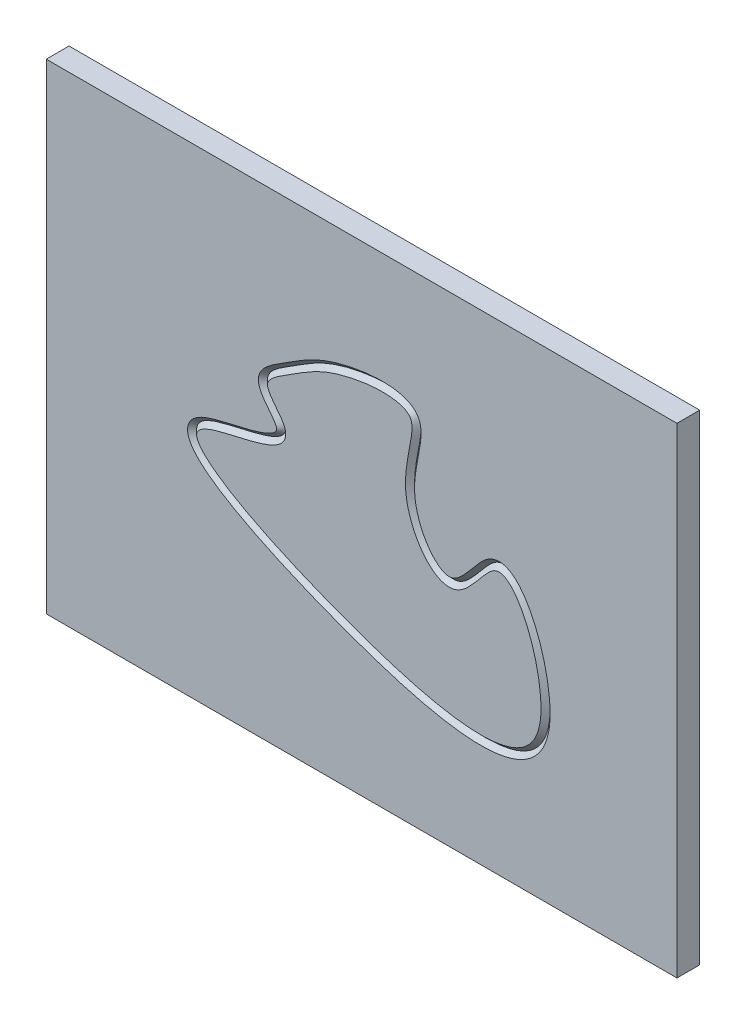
ISO-10303-21;
HEADER;
FILE_DESCRIPTION(('STEP AP214'),'2;1');
FILE_NAME('part.step','',(''),(''),'','','');
FILE_SCHEMA(('AUTOMOTIVE_DESIGN { 1 0 10303 214 1 1 1 1 }'));
ENDSEC;
DATA;
#1=APPLICATION_CONTEXT('core data for automotive mechanical design processes');
#2=APPLICATION_PROTOCOL_DEFINITION('international standard','automotive_design',2000,#1);
#3=PRODUCT_CONTEXT('',#1,'mechanical');
#4=PRODUCT('Part','Part','',(#3));
#5=PRODUCT_RELATED_PRODUCT_CATEGORY('part','',(#4));
#6=PRODUCT_DEFINITION_FORMATION('','',#4);
#7=PRODUCT_DEFINITION_CONTEXT('part definition',#1,'design');
#8=PRODUCT_DEFINITION('design','',#6,#7);
#9=PRODUCT_DEFINITION_SHAPE('','',#8);
#10=(LENGTH_UNIT() NAMED_UNIT(*) SI_UNIT(.MILLI.,.METRE.));
#11=(NAMED_UNIT(*) PLANE_ANGLE_UNIT() SI_UNIT($,.RADIAN.));
#12=(NAMED_UNIT(*) SI_UNIT($,.STERADIAN.) SOLID_ANGLE_UNIT());
#13=UNCERTAINTY_MEASURE_WITH_UNIT(LENGTH_MEASURE(1.E-05),#10,'distance_accuracy_value','');
#14=(GEOMETRIC_REPRESENTATION_CONTEXT(3) GLOBAL_UNCERTAINTY_ASSIGNED_CONTEXT((#13)) GLOBAL_UNIT_ASSIGNED_CONTEXT((#10,
#11,#12)) REPRESENTATION_CONTEXT('',''));
#15=CARTESIAN_POINT('',(0.,0.,0.));
#16=DIRECTION('',(0.,0.,1.));
#17=DIRECTION('',(1.,0.,0.));
#18=AXIS2_PLACEMENT_3D('',#15,#16,#17);
#19=CARTESIAN_POINT('',(-185.357577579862,137.493381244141,-15.));
#20=DIRECTION('',(-1.,0.,0.));
#21=DIRECTION('',(0.,0.,1.));
#22=AXIS2_PLACEMENT_3D('',#19,#20,#21);
#23=PLANE('',#22);
#24=DIRECTION('',(0.,-1.,0.));
#25=VECTOR('',#24,1.);
#26=CARTESIAN_POINT('',(-185.357577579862,137.493381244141,0.));
#27=LINE('',#26,#25);
#28=CARTESIAN_POINT('',(-185.357577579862,137.493381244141,0.));
#29=VERTEX_POINT('',#28);
#30=CARTESIAN_POINT('',(-185.357577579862,-178.842180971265,0.));
#31=VERTEX_POINT('',#30);
#32=EDGE_CURVE('E116',#29,#31,#27,.T.);
#33=ORIENTED_EDGE('',*,*,#32,.F.);
#34=DIRECTION('',(0.,0.,1.));
#35=VECTOR('',#34,1.);
#36=CARTESIAN_POINT('',(-185.357577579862,137.493381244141,-15.));
#37=LINE('',#36,#35);
#38=CARTESIAN_POINT('',(-185.357577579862,137.493381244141,-15.));
#39=VERTEX_POINT('',#38);
#40=EDGE_CURVE('E12',#39,#29,#37,.T.);
#41=ORIENTED_EDGE('',*,*,#40,.F.);
#42=DIRECTION('',(0.,-1.,0.));
#43=VECTOR('',#42,1.);
#44=CARTESIAN_POINT('',(-185.357577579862,137.493381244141,-15.));
#45=LINE('',#44,#43);
#46=CARTESIAN_POINT('',(-185.357577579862,-178.842180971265,-15.));
#47=VERTEX_POINT('',#46);
#48=EDGE_CURVE('E109',#39,#47,#45,.T.);
#49=ORIENTED_EDGE('',*,*,#48,.T.);
#50=DIRECTION('',(0.,0.,1.));
#51=VECTOR('',#50,1.);
#52=CARTESIAN_POINT('',(-185.357577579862,-178.842180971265,-15.));
#53=LINE('',#52,#51);
#54=EDGE_CURVE('E54',#47,#31,#53,.T.);
#55=ORIENTED_EDGE('',*,*,#54,.T.);
#56=EDGE_LOOP('',(#33,#41,#49,#55));
#57=FACE_BOUND('',#56,.T.);
#58=ADVANCED_FACE('F51',(#57),#23,.T.);
#59=CARTESIAN_POINT('',(-185.357577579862,137.493381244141,-15.));
#60=DIRECTION('',(0.,1.,0.));
#61=DIRECTION('',(0.,0.,1.));
#62=AXIS2_PLACEMENT_3D('',#59,#60,#61);
#63=PLANE('',#62);
#64=DIRECTION('',(-1.,0.,0.));
#65=VECTOR('',#64,1.);
#66=CARTESIAN_POINT('',(-185.357577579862,137.493381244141,0.));
#67=LINE('',#66,#65);
#68=CARTESIAN_POINT('',(229.967344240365,137.493381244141,0.));
#69=VERTEX_POINT('',#68);
#70=EDGE_CURVE('E111',#69,#29,#67,.T.);
#71=ORIENTED_EDGE('',*,*,#70,.F.);
#72=DIRECTION('',(0.,0.,1.));
#73=VECTOR('',#72,1.);
#74=CARTESIAN_POINT('',(229.967344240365,137.493381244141,-15.));
#75=LINE('',#74,#73);
#76=CARTESIAN_POINT('',(229.967344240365,137.493381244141,-15.));
#77=VERTEX_POINT('',#76);
#78=EDGE_CURVE('E60',#77,#69,#75,.T.);
#79=ORIENTED_EDGE('',*,*,#78,.F.);
#80=DIRECTION('',(-1.,0.,0.));
#81=VECTOR('',#80,1.);
#82=CARTESIAN_POINT('',(-185.357577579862,137.493381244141,-15.));
#83=LINE('',#82,#81);
#84=EDGE_CURVE('E106',#77,#39,#83,.T.);
#85=ORIENTED_EDGE('',*,*,#84,.T.);
#86=ORIENTED_EDGE('',*,*,#40,.T.);
#87=EDGE_LOOP('',(#71,#79,#85,#86));
#88=FACE_BOUND('',#87,.T.);
#89=ADVANCED_FACE('F127',(#88),#63,.T.);
#90=CARTESIAN_POINT('',(229.967344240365,137.493381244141,-15.));
#91=DIRECTION('',(1.,0.,0.));
#92=DIRECTION('',(0.,0.,-1.));
#93=AXIS2_PLACEMENT_3D('',#90,#91,#92);
#94=PLANE('',#93);
#95=DIRECTION('',(0.,1.,0.));
#96=VECTOR('',#95,1.);
#97=CARTESIAN_POINT('',(229.967344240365,137.493381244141,0.));
#98=LINE('',#97,#96);
#99=CARTESIAN_POINT('',(229.967344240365,-178.842180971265,0.));
#100=VERTEX_POINT('',#99);
#101=EDGE_CURVE('E101',#100,#69,#98,.T.);
#102=ORIENTED_EDGE('',*,*,#101,.F.);
#103=DIRECTION('',(0.,0.,1.));
#104=VECTOR('',#103,1.);
#105=CARTESIAN_POINT('',(229.967344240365,-178.842180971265,-15.));
#106=LINE('',#105,#104);
#107=CARTESIAN_POINT('',(229.967344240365,-178.842180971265,-15.));
#108=VERTEX_POINT('',#107);
#109=EDGE_CURVE('E96',#108,#100,#106,.T.);
#110=ORIENTED_EDGE('',*,*,#109,.F.);
#111=DIRECTION('',(0.,1.,0.));
#112=VECTOR('',#111,1.);
#113=CARTESIAN_POINT('',(229.967344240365,137.493381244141,-15.));
#114=LINE('',#113,#112);
#115=EDGE_CURVE('E99',#108,#77,#114,.T.);
#116=ORIENTED_EDGE('',*,*,#115,.T.);
#117=ORIENTED_EDGE('',*,*,#78,.T.);
#118=EDGE_LOOP('',(#102,#110,#116,#117));
#119=FACE_BOUND('',#118,.T.);
#120=ADVANCED_FACE('F98',(#119),#94,.T.);
#121=CARTESIAN_POINT('',(-185.357577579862,-178.842180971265,-15.));
#122=DIRECTION('',(0.,-1.,0.));
#123=DIRECTION('',(0.,0.,-1.));
#124=AXIS2_PLACEMENT_3D('',#121,#122,#123);
#125=PLANE('',#124);
#126=DIRECTION('',(1.,0.,0.));
#127=VECTOR('',#126,1.);
#128=CARTESIAN_POINT('',(-185.357577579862,-178.842180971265,0.));
#129=LINE('',#128,#127);
#130=EDGE_CURVE('E119',#31,#100,#129,.T.);
#131=ORIENTED_EDGE('',*,*,#130,.F.);
#132=ORIENTED_EDGE('',*,*,#54,.F.);
#133=DIRECTION('',(1.,0.,0.));
#134=VECTOR('',#133,1.);
#135=CARTESIAN_POINT('',(-185.357577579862,-178.842180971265,-15.));
#136=LINE('',#135,#134);
#137=EDGE_CURVE('E105',#47,#108,#136,.T.);
#138=ORIENTED_EDGE('',*,*,#137,.T.);
#139=ORIENTED_EDGE('',*,*,#109,.T.);
#140=EDGE_LOOP('',(#131,#132,#138,#139));
#141=FACE_BOUND('',#140,.T.);
#142=ADVANCED_FACE('F108',(#141),#125,.T.);
#143=CARTESIAN_POINT('',(-185.357577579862,-178.842180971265,-15.));
#144=DIRECTION('',(0.,0.,1.));
#145=DIRECTION('',(1.,0.,0.));
#146=AXIS2_PLACEMENT_3D('',#143,#144,#145);
#147=PLANE('',#146);
#148=ORIENTED_EDGE('',*,*,#48,.F.);
#149=ORIENTED_EDGE('',*,*,#84,.F.);
#150=ORIENTED_EDGE('',*,*,#115,.F.);
#151=ORIENTED_EDGE('',*,*,#137,.F.);
#152=EDGE_LOOP('',(#148,#149,#150,#151));
#153=FACE_BOUND('',#152,.T.);
#154=ADVANCED_FACE('F104',(#153),#147,.F.);
#155=CARTESIAN_POINT('',(-185.357577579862,-178.842180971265,0.));
#156=DIRECTION('',(0.,0.,1.));
#157=DIRECTION('',(1.,0.,0.));
#158=AXIS2_PLACEMENT_3D('',#155,#156,#157);
#159=PLANE('',#158);
#160=CARTESIAN_POINT('',(-28.9610457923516,42.4194717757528,0.));
#161=CARTESIAN_POINT('',(-31.3596570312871,40.9239144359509,0.));
#162=CARTESIAN_POINT('',(-36.5282389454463,37.7757005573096,0.));
#163=CARTESIAN_POINT('',(-41.7431895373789,33.5285812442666,0.));
#164=CARTESIAN_POINT('',(-44.1840860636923,30.0135024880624,0.));
#165=CARTESIAN_POINT('',(-45.1233597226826,28.0652061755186,0.));
#166=CARTESIAN_POINT('',(-45.6066969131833,26.2082258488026,0.));
#167=CARTESIAN_POINT('',(-45.7030968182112,24.6866749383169,0.));
#168=CARTESIAN_POINT('',(-45.6121095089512,22.9183443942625,0.));
#169=CARTESIAN_POINT('',(-45.0581061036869,20.7255390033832,0.));
#170=CARTESIAN_POINT('',(-43.8311611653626,18.0980591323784,0.));
#171=CARTESIAN_POINT('',(-41.2542666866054,13.9620516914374,0.));
#172=CARTESIAN_POINT('',(-36.7559472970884,8.62488937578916,0.));
#173=CARTESIAN_POINT('',(-34.2795900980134,4.80595829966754,0.));
#174=CARTESIAN_POINT('',(-33.7606687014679,3.31769811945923,0.));
#175=CARTESIAN_POINT('',(-33.6564605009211,2.81054166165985,0.));
#176=CARTESIAN_POINT('',(-33.6474759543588,2.2052734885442,0.));
#177=CARTESIAN_POINT('',(-33.7586134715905,1.67394307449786,0.));
#178=CARTESIAN_POINT('',(-34.0323540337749,1.0464044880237,0.));
#179=CARTESIAN_POINT('',(-34.6124061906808,0.246659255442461,0.));
#180=CARTESIAN_POINT('',(-35.6744779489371,-0.727251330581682,0.));
#181=CARTESIAN_POINT('',(-38.647036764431,-2.74686395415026,0.));
#182=CARTESIAN_POINT('',(-45.9421427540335,-5.60663483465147,0.));
#183=CARTESIAN_POINT('',(-59.1605846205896,-8.81589340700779,0.));
#184=CARTESIAN_POINT('',(-71.9027962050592,-11.6349220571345,0.));
#185=CARTESIAN_POINT('',(-80.1466192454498,-14.167253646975,0.));
#186=CARTESIAN_POINT('',(-84.2592403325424,-16.1079079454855,0.));
#187=CARTESIAN_POINT('',(-86.5151077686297,-17.4617794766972,0.));
#188=CARTESIAN_POINT('',(-88.3611262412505,-18.8898538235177,0.));
#189=CARTESIAN_POINT('',(-89.9019303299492,-20.4802282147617,0.));
#190=CARTESIAN_POINT('',(-91.1085942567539,-22.2498774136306,0.));
#191=CARTESIAN_POINT('',(-91.9328273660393,-24.1851010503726,0.));
#192=CARTESIAN_POINT('',(-92.3331022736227,-26.2250506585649,0.));
#193=CARTESIAN_POINT('',(-92.3121625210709,-28.2852975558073,0.));
#194=CARTESIAN_POINT('',(-91.8716461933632,-30.5304271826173,0.));
#195=CARTESIAN_POINT('',(-90.9325865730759,-32.9163970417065,0.));
#196=CARTESIAN_POINT('',(-89.4383565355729,-35.4383160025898,0.));
#197=CARTESIAN_POINT('',(-87.5255157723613,-37.920208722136,0.));
#198=CARTESIAN_POINT('',(-82.5525286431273,-43.2533476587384,0.));
#199=CARTESIAN_POINT('',(-71.5471916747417,-51.5605293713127,0.));
#200=CARTESIAN_POINT('',(-50.9594298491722,-63.1418014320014,0.));
#201=CARTESIAN_POINT('',(-23.6210506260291,-75.95599894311,0.));
#202=CARTESIAN_POINT('',(6.24939582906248,-87.9281783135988,0.));
#203=CARTESIAN_POINT('',(38.0741577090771,-99.0796874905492,0.));
#204=CARTESIAN_POINT('',(67.9134180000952,-107.41359175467,0.));
#205=CARTESIAN_POINT('',(91.0227383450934,-110.861772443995,0.));
#206=CARTESIAN_POINT('',(106.299870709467,-110.837093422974,0.));
#207=CARTESIAN_POINT('',(115.632256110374,-109.714194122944,0.));
#208=CARTESIAN_POINT('',(124.034302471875,-107.356065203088,0.));
#209=CARTESIAN_POINT('',(131.395628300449,-103.611017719,0.));
#210=CARTESIAN_POINT('',(137.188837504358,-98.6365437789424,0.));
#211=CARTESIAN_POINT('',(141.449522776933,-92.6905578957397,0.));
#212=CARTESIAN_POINT('',(144.330877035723,-86.0762389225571,0.));
#213=CARTESIAN_POINT('',(145.876180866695,-79.2677079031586,0.));
#214=CARTESIAN_POINT('',(146.379940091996,-73.6039308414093,0.));
#215=CARTESIAN_POINT('',(146.493923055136,-67.5941116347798,0.));
#216=CARTESIAN_POINT('',(146.053422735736,-60.1658356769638,0.));
#217=CARTESIAN_POINT('',(144.148965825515,-47.7642432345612,0.));
#218=CARTESIAN_POINT('',(140.197917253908,-32.8597857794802,0.));
#219=CARTESIAN_POINT('',(134.991829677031,-20.4311780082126,0.));
#220=CARTESIAN_POINT('',(130.442435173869,-12.6310854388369,0.));
#221=CARTESIAN_POINT('',(127.194920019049,-8.14202830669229,0.));
#222=CARTESIAN_POINT('',(123.686182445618,-4.42463827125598,0.));
#223=CARTESIAN_POINT('',(120.488422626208,-2.07230493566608,0.));
#224=CARTESIAN_POINT('',(117.716793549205,-0.750476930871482,0.));
#225=CARTESIAN_POINT('',(115.521429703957,-0.0873596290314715,0.));
#226=CARTESIAN_POINT('',(113.2383582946,0.190393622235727,0.));
#227=CARTESIAN_POINT('',(110.913334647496,0.0357129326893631,0.));
#228=CARTESIAN_POINT('',(108.699918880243,-0.541706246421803,0.));
#229=CARTESIAN_POINT('',(107.206913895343,-1.2245754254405,0.));
#230=CARTESIAN_POINT('',(104.318464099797,-2.83237678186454,0.));
#231=CARTESIAN_POINT('',(100.400620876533,-6.37855822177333,0.));
#232=CARTESIAN_POINT('',(95.58489831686,-12.1615401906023,0.));
#233=CARTESIAN_POINT('',(91.4260094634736,-17.1643058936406,0.));
#234=CARTESIAN_POINT('',(87.9171676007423,-20.9255926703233,0.));
#235=CARTESIAN_POINT('',(84.6832393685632,-23.5374360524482,0.));
#236=CARTESIAN_POINT('',(82.7062218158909,-24.4803841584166,0.));
#237=CARTESIAN_POINT('',(81.1189164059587,-24.8945402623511,0.));
#238=CARTESIAN_POINT('',(79.7391255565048,-25.0167786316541,0.));
#239=CARTESIAN_POINT('',(77.7307473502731,-24.6950426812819,0.));
#240=CARTESIAN_POINT('',(75.213093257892,-23.7003233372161,0.));
#241=CARTESIAN_POINT('',(72.1598007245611,-21.655004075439,0.));
#242=CARTESIAN_POINT('',(67.5826107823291,-17.0909219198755,0.));
#243=CARTESIAN_POINT('',(62.367810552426,-9.07033508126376,0.));
#244=CARTESIAN_POINT('',(58.8144322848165,0.596208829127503,0.));
#245=CARTESIAN_POINT('',(57.3646585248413,8.46348674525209,0.));
#246=CARTESIAN_POINT('',(56.9966510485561,16.2476741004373,0.));
#247=CARTESIAN_POINT('',(58.4623767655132,29.7729687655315,0.));
#248=CARTESIAN_POINT('',(61.5302268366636,41.2959861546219,0.));
#249=CARTESIAN_POINT('',(61.4706437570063,49.2976059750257,0.));
#250=CARTESIAN_POINT('',(61.0568323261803,52.1984203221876,0.));
#251=CARTESIAN_POINT('',(60.2646559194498,54.556887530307,0.));
#252=CARTESIAN_POINT('',(59.2963629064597,56.2889504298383,0.));
#253=CARTESIAN_POINT('',(58.1211176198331,57.8941629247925,0.));
#254=CARTESIAN_POINT('',(56.3659946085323,59.5690368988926,0.));
#255=CARTESIAN_POINT('',(53.2533526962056,61.5391541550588,0.));
#256=CARTESIAN_POINT('',(48.9653038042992,63.1379245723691,0.));
#257=CARTESIAN_POINT('',(43.313863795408,64.1786729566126,0.));
#258=CARTESIAN_POINT('',(37.0971039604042,64.5523483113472,0.));
#259=CARTESIAN_POINT('',(25.7272133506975,64.2021459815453,0.));
#260=CARTESIAN_POINT('',(11.5116185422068,61.7487078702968,0.));
#261=CARTESIAN_POINT('',(-2.7982052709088,57.1753476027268,0.));
#262=CARTESIAN_POINT('',(-15.028069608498,51.499843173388,0.));
#263=CARTESIAN_POINT('',(-22.5647491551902,46.4076246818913,0.));
#264=CARTESIAN_POINT('',(-28.9610457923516,42.4194717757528,0.));
#265=B_SPLINE_CURVE_WITH_KNOTS('',3,(#160,#161,#162,#163,#164,#165,#166,#167,#168,#169,#170,
#171,#172,#173,#174,#175,#176,#177,#178,#179,#180,#181,#182,#183,#184,#185,#186,#187,#188,#189,
#190,#191,#192,#193,#194,#195,#196,#197,#198,#199,#200,#201,#202,#203,#204,#205,#206,#207,#208,
#209,#210,#211,#212,#213,#214,#215,#216,#217,#218,#219,#220,#221,#222,#223,#224,#225,#226,#227,
#228,#229,#230,#231,#232,#233,#234,#235,#236,#237,#238,#239,#240,#241,#242,#243,#244,#245,#246,
#247,#248,#249,#250,#251,#252,#253,#254,#255,#256,#257,#258,#259,#260,#261,#262,#263,#264),
.UNSPECIFIED.,.T.,.F.,(4,1,1,1,1,1,1,1,1,1,1,1,1,1,1,1,1,1,1,1,1,1,1,1,1,1,1,1,1,1,1,1,1,1,1,1,
1,1,1,1,1,1,1,1,1,1,1,1,1,1,1,1,1,1,1,1,1,1,1,1,1,1,1,1,1,1,1,1,1,1,1,1,1,1,1,1,1,1,1,1,1,1,1,1,
1,1,1,1,1,1,1,1,1,1,1,1,1,1,1,1,1,1,4),(0.,0.01171875,0.0234375,0.0263671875,0.029296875,
0.0322265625,0.0339758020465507,0.03515625,0.0390625,0.04296875,0.0468750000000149,0.05859375,
0.0702791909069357,0.0703125,0.0732421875,0.076171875,0.0791015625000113,0.08203125,0.0859375,
0.08984375,0.09375,0.109375,0.125,0.142578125,0.155106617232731,0.16015624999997,0.16455078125,
0.1689453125,0.173339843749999,0.177734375,0.18212890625,0.1865234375,0.19091796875,
0.195312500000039,0.201171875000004,0.20703125,0.212890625,0.218750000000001,0.245000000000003,
0.27125,0.2975,0.333051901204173,0.359375,0.39453125,0.4296875,0.44375,0.4578125,0.471875,
0.4859375,0.5,0.51171875,0.523437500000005,0.53515625,0.54310440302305,0.546875,0.55859375,
0.5703125,0.59,0.6096875,0.61742187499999,0.62515625,0.632890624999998,0.640625,0.64453125,
0.648437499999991,0.652343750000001,0.65625,0.66015625,0.663632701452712,0.6640625,0.67578125,
0.6875,0.6953125,0.703125,0.710937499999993,0.717533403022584,0.71875,0.723958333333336,
0.729166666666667,0.734375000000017,0.7421875,0.750000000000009,0.765625,0.78125,
0.788869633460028,0.796875,0.8125,0.84375,0.848958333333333,0.854166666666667,0.859375,
0.862241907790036,0.864583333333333,0.869791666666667,0.875,0.88375000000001,0.8925,0.90125,
0.91,0.9375,0.953600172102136,0.96875,1.),.UNSPECIFIED.);
#266=CARTESIAN_POINT('',(-28.9610457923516,42.4194717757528,0.));
#267=VERTEX_POINT('',#266);
#268=EDGE_CURVE('E178',#267,#267,#265,.T.);
#269=ORIENTED_EDGE('',*,*,#268,.F.);
#270=EDGE_LOOP('',(#269));
#271=FACE_BOUND('',#270,.T.);
#272=ORIENTED_EDGE('',*,*,#32,.T.);
#273=ORIENTED_EDGE('',*,*,#130,.T.);
#274=ORIENTED_EDGE('',*,*,#101,.T.);
#275=ORIENTED_EDGE('',*,*,#70,.T.);
#276=EDGE_LOOP('',(#272,#273,#274,#275));
#277=FACE_BOUND('',#276,.T.);
#278=ADVANCED_FACE('F126',(#271,#277),#159,.T.);
#279=CARTESIAN_POINT('',(-27.3753796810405,39.8727752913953,-3.00000000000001));
#280=CARTESIAN_POINT('',(-29.7592075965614,38.3885170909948,-3.00000000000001));
#281=CARTESIAN_POINT('',(-34.8885349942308,35.2678333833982,-3.00000000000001));
#282=CARTESIAN_POINT('',(-39.6288274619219,31.3249604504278,-3.));
#283=CARTESIAN_POINT('',(-41.5914546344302,28.4789488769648,-3.));
#284=CARTESIAN_POINT('',(-42.2948387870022,27.0105878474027,-3.00000000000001));
#285=CARTESIAN_POINT('',(-42.6298949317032,25.6985586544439,-3.00000000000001));
#286=CARTESIAN_POINT('',(-42.6990609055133,24.6620327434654,-3.));
#287=CARTESIAN_POINT('',(-42.6328718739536,23.433226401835,-3.00000000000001));
#288=CARTESIAN_POINT('',(-42.229992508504,21.7758341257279,-3.00000000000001));
#289=CARTESIAN_POINT('',(-41.2033673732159,19.5591693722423,-3.00000000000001));
#290=CARTESIAN_POINT('',(-38.8736402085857,15.8112866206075,-3.00000000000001));
#291=CARTESIAN_POINT('',(-34.4936725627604,10.5369892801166,-3.));
#292=CARTESIAN_POINT('',(-31.636368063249,6.41395852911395,-3.));
#293=CARTESIAN_POINT('',(-30.8642104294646,4.10263205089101,-3.00000000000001));
#294=CARTESIAN_POINT('',(-30.6566309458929,3.19984243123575,-3.));
#295=CARTESIAN_POINT('',(-30.6349418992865,1.92912668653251,-3.));
#296=CARTESIAN_POINT('',(-30.8851776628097,0.730411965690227,-3.00000000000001));
#297=CARTESIAN_POINT('',(-31.4475835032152,-0.525728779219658,-3.));
#298=CARTESIAN_POINT('',(-32.4083582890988,-1.81568950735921,-3.00000000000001));
#299=CARTESIAN_POINT('',(-33.8451110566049,-3.11751297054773,-3.));
#300=CARTESIAN_POINT('',(-37.42005657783,-5.52842337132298,-3.00000000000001));
#301=CARTESIAN_POINT('',(-45.1285136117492,-8.48981319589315,-3.));
#302=CARTESIAN_POINT('',(-58.5204683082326,-11.7498968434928,-3.));
#303=CARTESIAN_POINT('',(-71.2204901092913,-14.5540456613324,-3.));
#304=CARTESIAN_POINT('',(-79.1208348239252,-17.0062414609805,-3.));
#305=CARTESIAN_POINT('',(-82.8657655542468,-18.769354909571,-3.));
#306=CARTESIAN_POINT('',(-84.8328899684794,-19.954316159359,-3.));
#307=CARTESIAN_POINT('',(-86.3691660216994,-21.1465828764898,-3.));
#308=CARTESIAN_POINT('',(-87.5770705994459,-22.3995747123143,-3.00000000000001));
#309=CARTESIAN_POINT('',(-88.4659600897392,-23.7106171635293,-3.00000000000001));
#310=CARTESIAN_POINT('',(-89.0451908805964,-25.077035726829,-3.00000000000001));
#311=CARTESIAN_POINT('',(-89.324119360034,-26.4961558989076,-3.00000000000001));
#312=CARTESIAN_POINT('',(-89.3121019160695,-27.9653031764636,-3.00000000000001));
#313=CARTESIAN_POINT('',(-88.9858719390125,-29.6503030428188,-3.));
#314=CARTESIAN_POINT('',(-88.238834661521,-31.5675105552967,-3.));
#315=CARTESIAN_POINT('',(-86.9620929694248,-33.7320978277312,-3.00000000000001));
#316=CARTESIAN_POINT('',(-85.2457374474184,-35.9634337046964,-3.));
#317=CARTESIAN_POINT('',(-80.6367483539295,-40.9136027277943,-3.00000000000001));
#318=CARTESIAN_POINT('',(-69.9569818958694,-49.0140550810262,-3.00000000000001));
#319=CARTESIAN_POINT('',(-49.6069052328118,-60.459957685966,-3.));
#320=CARTESIAN_POINT('',(-22.4424753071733,-73.1965114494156,-3.00000000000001));
#321=CARTESIAN_POINT('',(7.31396324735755,-85.1204762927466,-3.00000000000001));
#322=CARTESIAN_POINT('',(38.9881717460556,-96.2209973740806,-3.));
#323=CARTESIAN_POINT('',(68.5858662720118,-104.483915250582,-3.));
#324=CARTESIAN_POINT('',(91.3245507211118,-107.863193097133,-3.));
#325=CARTESIAN_POINT('',(106.140463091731,-107.834488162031,-3.));
#326=CARTESIAN_POINT('',(115.072389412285,-106.755153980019,-3.00000000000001));
#327=CARTESIAN_POINT('',(122.966228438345,-104.531867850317,-3.));
#328=CARTESIAN_POINT('',(129.729241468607,-101.080875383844,-3.00000000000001));
#329=CARTESIAN_POINT('',(134.960942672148,-96.5830029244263,-3.));
#330=CARTESIAN_POINT('',(138.812353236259,-91.2128692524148,-3.00000000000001));
#331=CARTESIAN_POINT('',(141.455282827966,-85.1610005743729,-3.00000000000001));
#332=CARTESIAN_POINT('',(142.902867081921,-78.806686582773,-3.));
#333=CARTESIAN_POINT('',(143.382434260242,-73.4381905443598,-3.00000000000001));
#334=CARTESIAN_POINT('',(143.4914999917,-67.687301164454,-3.00000000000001));
#335=CARTESIAN_POINT('',(143.067738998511,-60.4964185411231,-3.00000000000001));
#336=CARTESIAN_POINT('',(141.211195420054,-48.400457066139,-3.));
#337=CARTESIAN_POINT('',(137.344950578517,-33.8120471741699,-3.00000000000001));
#338=CARTESIAN_POINT('',(132.27014867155,-21.7172628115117,-3.));
#339=CARTESIAN_POINT('',(127.914652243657,-14.2553856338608,-3.));
#340=CARTESIAN_POINT('',(124.860093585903,-10.0385562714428,-3.00000000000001));
#341=CARTESIAN_POINT('',(121.657266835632,-6.6554265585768,-3.00000000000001));
#342=CARTESIAN_POINT('',(118.885485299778,-4.63156286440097,-3.00000000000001));
#343=CARTESIAN_POINT('',(116.618524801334,-3.55469142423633,-3.));
#344=CARTESIAN_POINT('',(114.892172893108,-3.03594929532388,-3.));
#345=CARTESIAN_POINT('',(113.152312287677,-2.82636936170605,-3.00000000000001));
#346=CARTESIAN_POINT('',(111.403022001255,-2.94214380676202,-3.));
#347=CARTESIAN_POINT('',(109.712734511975,-3.38269204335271,-3.00000000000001));
#348=CARTESIAN_POINT('',(108.542172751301,-3.91294473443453,-3.00000000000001));
#349=CARTESIAN_POINT('',(106.202621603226,-5.22154966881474,-3.00000000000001));
#350=CARTESIAN_POINT('',(102.635454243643,-8.37891172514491,-3.));
#351=CARTESIAN_POINT('',(97.9154873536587,-14.0506582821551,-3.));
#352=CARTESIAN_POINT('',(93.7014874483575,-19.1222366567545,-3.00000000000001));
#353=CARTESIAN_POINT('',(90.0099188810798,-23.0810667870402,-3.));
#354=CARTESIAN_POINT('',(86.413724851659,-26.0274994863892,-3.00000000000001));
#355=CARTESIAN_POINT('',(83.8090988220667,-27.2915877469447,-3.));
#356=CARTESIAN_POINT('',(81.5991334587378,-27.8714697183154,-3.));
#357=CARTESIAN_POINT('',(79.5991445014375,-28.0478418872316,-3.));
#358=CARTESIAN_POINT('',(76.8894853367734,-27.5984995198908,-3.));
#359=CARTESIAN_POINT('',(73.7384477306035,-26.3411940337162,-3.00000000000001));
#360=CARTESIAN_POINT('',(70.2055136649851,-23.9535022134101,-3.));
#361=CARTESIAN_POINT('',(65.1737814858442,-18.921060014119,-3.00000000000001));
#362=CARTESIAN_POINT('',(59.65752498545,-10.3984685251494,-3.));
#363=CARTESIAN_POINT('',(55.9151281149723,-0.252587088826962,-3.00000000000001));
#364=CARTESIAN_POINT('',(54.3817349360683,8.12528751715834,-3.00000000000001));
#365=CARTESIAN_POINT('',(53.9813300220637,16.3975942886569,-3.00000000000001));
#366=CARTESIAN_POINT('',(55.5409359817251,30.4228102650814,-3.00000000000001));
#367=CARTESIAN_POINT('',(58.538475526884,41.9717529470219,-3.));
#368=CARTESIAN_POINT('',(58.4678577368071,49.0997865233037,-3.));
#369=CARTESIAN_POINT('',(58.1159346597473,51.5284808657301,-3.00000000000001));
#370=CARTESIAN_POINT('',(57.4882632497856,53.3701150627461,-3.));
#371=CARTESIAN_POINT('',(56.7648721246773,54.6692774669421,-3.00000000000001));
#372=CARTESIAN_POINT('',(55.8811896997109,55.8715900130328,-3.00000000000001));
#373=CARTESIAN_POINT('',(54.5252741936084,57.1755863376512,-3.));
#374=CARTESIAN_POINT('',(51.9717511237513,58.8007620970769,-3.));
#375=CARTESIAN_POINT('',(48.2067103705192,60.2209601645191,-3.));
#376=CARTESIAN_POINT('',(42.9781072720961,61.1905566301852,-3.00000000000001));
#377=CARTESIAN_POINT('',(37.0687769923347,61.5482409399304,-3.));
#378=CARTESIAN_POINT('',(26.1068961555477,61.2156015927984,-3.00000000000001));
#379=CARTESIAN_POINT('',(12.1587090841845,58.7980791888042,-3.00000000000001));
#380=CARTESIAN_POINT('',(-1.68044804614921,54.3989604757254,-3.));
#381=CARTESIAN_POINT('',(-13.4892146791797,48.9043140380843,-3.));
#382=CARTESIAN_POINT('',(-21.0185052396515,43.8307971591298,-3.00000000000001));
#383=CARTESIAN_POINT('',(-27.3753796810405,39.8727752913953,-3.00000000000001));
#384=CARTESIAN_POINT('',(-25.7897135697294,37.3260788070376,0.));
#385=CARTESIAN_POINT('',(-28.1587581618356,35.8531197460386,0.));
#386=CARTESIAN_POINT('',(-33.2488310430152,32.7599662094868,0.));
#387=CARTESIAN_POINT('',(-37.5144653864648,29.121339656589,0.));
#388=CARTESIAN_POINT('',(-38.9988232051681,26.9443952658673,0.));
#389=CARTESIAN_POINT('',(-39.4663178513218,25.9559695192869,0.));
#390=CARTESIAN_POINT('',(-39.653092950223,25.1888914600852,0.));
#391=CARTESIAN_POINT('',(-39.6950249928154,24.6373905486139,0.));
#392=CARTESIAN_POINT('',(-39.6536342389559,23.9481084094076,0.));
#393=CARTESIAN_POINT('',(-39.401878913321,22.8261292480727,0.));
#394=CARTESIAN_POINT('',(-38.575573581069,21.0202796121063,0.));
#395=CARTESIAN_POINT('',(-36.4930137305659,17.6605215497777,0.));
#396=CARTESIAN_POINT('',(-32.2313978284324,12.4490891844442,0.));
#397=CARTESIAN_POINT('',(-28.9931460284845,8.02195875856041,0.));
#398=CARTESIAN_POINT('',(-27.9677521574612,4.88756598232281,0.));
#399=CARTESIAN_POINT('',(-27.6568013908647,3.58914320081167,0.));
#400=CARTESIAN_POINT('',(-27.6224078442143,1.65297988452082,0.));
#401=CARTESIAN_POINT('',(-28.0117418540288,-0.213119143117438,0.));
#402=CARTESIAN_POINT('',(-28.8628129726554,-2.09786204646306,0.));
#403=CARTESIAN_POINT('',(-30.2043103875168,-3.87803827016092,0.));
#404=CARTESIAN_POINT('',(-32.0157441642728,-5.50777461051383,0.));
#405=CARTESIAN_POINT('',(-36.193076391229,-8.30998278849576,0.));
#406=CARTESIAN_POINT('',(-44.3148844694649,-11.3729915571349,0.));
#407=CARTESIAN_POINT('',(-57.8803519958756,-14.6839002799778,0.));
#408=CARTESIAN_POINT('',(-70.5381840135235,-17.4731692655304,0.));
#409=CARTESIAN_POINT('',(-78.0950504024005,-19.8452292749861,0.));
#410=CARTESIAN_POINT('',(-81.4722907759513,-21.4308018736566,0.));
#411=CARTESIAN_POINT('',(-83.1506721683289,-22.4468528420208,0.));
#412=CARTESIAN_POINT('',(-84.3772058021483,-23.403311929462,0.));
#413=CARTESIAN_POINT('',(-85.2522108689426,-24.3189212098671,0.));
#414=CARTESIAN_POINT('',(-85.8233259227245,-25.171356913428,0.));
#415=CARTESIAN_POINT('',(-86.1575543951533,-25.9689704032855,0.));
#416=CARTESIAN_POINT('',(-86.3151364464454,-26.7672611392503,0.));
#417=CARTESIAN_POINT('',(-86.312041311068,-27.6453087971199,0.));
#418=CARTESIAN_POINT('',(-86.1000976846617,-28.7701789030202,0.));
#419=CARTESIAN_POINT('',(-85.545082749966,-30.218624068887,0.));
#420=CARTESIAN_POINT('',(-84.4858294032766,-32.0258796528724,0.));
#421=CARTESIAN_POINT('',(-82.9659591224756,-34.0066586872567,0.));
#422=CARTESIAN_POINT('',(-78.7209680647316,-38.5738577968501,0.));
#423=CARTESIAN_POINT('',(-68.3667721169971,-46.4675807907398,0.));
#424=CARTESIAN_POINT('',(-48.2543806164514,-57.7781139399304,0.));
#425=CARTESIAN_POINT('',(-21.2638999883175,-70.4370239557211,0.));
#426=CARTESIAN_POINT('',(8.37853066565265,-82.3127742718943,0.));
#427=CARTESIAN_POINT('',(39.9021857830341,-93.3623072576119,0.));
#428=CARTESIAN_POINT('',(69.2583145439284,-101.554238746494,0.));
#429=CARTESIAN_POINT('',(91.6263630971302,-104.864613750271,0.));
#430=CARTESIAN_POINT('',(105.981055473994,-104.831882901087,0.));
#431=CARTESIAN_POINT('',(114.512522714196,-103.796113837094,0.));
#432=CARTESIAN_POINT('',(121.898154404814,-101.707670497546,0.));
#433=CARTESIAN_POINT('',(128.062854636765,-98.5507330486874,0.));
#434=CARTESIAN_POINT('',(132.733047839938,-94.5294620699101,0.));
#435=CARTESIAN_POINT('',(136.175183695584,-89.7351806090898,0.));
#436=CARTESIAN_POINT('',(138.579688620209,-84.2457622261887,0.));
#437=CARTESIAN_POINT('',(139.929553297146,-78.3456652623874,0.));
#438=CARTESIAN_POINT('',(140.384928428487,-73.2724502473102,0.));
#439=CARTESIAN_POINT('',(140.489076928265,-67.7804906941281,0.));
#440=CARTESIAN_POINT('',(140.082055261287,-60.8270014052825,0.));
#441=CARTESIAN_POINT('',(138.273425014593,-49.0366708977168,0.));
#442=CARTESIAN_POINT('',(134.491983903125,-34.7643085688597,0.));
#443=CARTESIAN_POINT('',(129.54846766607,-23.0033476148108,0.));
#444=CARTESIAN_POINT('',(125.386869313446,-15.8796858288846,0.));
#445=CARTESIAN_POINT('',(122.525267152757,-11.9350842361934,0.));
#446=CARTESIAN_POINT('',(119.628351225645,-8.88621484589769,0.));
#447=CARTESIAN_POINT('',(117.282547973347,-7.19082079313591,0.));
#448=CARTESIAN_POINT('',(115.520256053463,-6.35890591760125,0.));
#449=CARTESIAN_POINT('',(114.262916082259,-5.98453896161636,0.));
#450=CARTESIAN_POINT('',(113.066266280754,-5.84313234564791,0.));
#451=CARTESIAN_POINT('',(111.892709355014,-5.92000054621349,0.));
#452=CARTESIAN_POINT('',(110.725550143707,-6.22367784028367,0.));
#453=CARTESIAN_POINT('',(109.877431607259,-6.60131404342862,0.));
#454=CARTESIAN_POINT('',(108.086779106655,-7.61072255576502,0.));
#455=CARTESIAN_POINT('',(104.870287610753,-10.3792652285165,0.));
#456=CARTESIAN_POINT('',(100.246076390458,-15.9397763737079,0.));
#457=CARTESIAN_POINT('',(95.9769654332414,-21.0801674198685,0.));
#458=CARTESIAN_POINT('',(92.1026701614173,-25.2365409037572,0.));
#459=CARTESIAN_POINT('',(88.1442103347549,-28.5175629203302,0.));
#460=CARTESIAN_POINT('',(84.9119758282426,-30.102791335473,0.));
#461=CARTESIAN_POINT('',(82.0793505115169,-30.8483991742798,0.));
#462=CARTESIAN_POINT('',(79.4591634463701,-31.0789051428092,0.));
#463=CARTESIAN_POINT('',(76.0482233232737,-30.5019563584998,0.));
#464=CARTESIAN_POINT('',(72.263802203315,-28.9820647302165,0.));
#465=CARTESIAN_POINT('',(68.2512266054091,-26.2520003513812,0.));
#466=CARTESIAN_POINT('',(62.7649521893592,-20.7511981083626,0.));
#467=CARTESIAN_POINT('',(56.9472394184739,-11.726601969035,0.));
#468=CARTESIAN_POINT('',(53.015823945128,-1.10138300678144,0.));
#469=CARTESIAN_POINT('',(51.3988113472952,7.78708828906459,0.));
#470=CARTESIAN_POINT('',(50.9660089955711,16.5475144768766,0.));
#471=CARTESIAN_POINT('',(52.6194951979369,31.0726517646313,0.));
#472=CARTESIAN_POINT('',(55.5467242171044,42.6475197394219,0.));
#473=CARTESIAN_POINT('',(55.4650717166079,48.9019670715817,0.));
#474=CARTESIAN_POINT('',(55.1750369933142,50.8585414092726,0.));
#475=CARTESIAN_POINT('',(54.7118705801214,52.1833425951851,0.));
#476=CARTESIAN_POINT('',(54.2333813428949,53.0496045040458,0.));
#477=CARTESIAN_POINT('',(53.6412617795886,53.849017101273,0.));
#478=CARTESIAN_POINT('',(52.6845537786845,54.7821357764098,0.));
#479=CARTESIAN_POINT('',(50.690149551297,56.062370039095,0.));
#480=CARTESIAN_POINT('',(47.4481169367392,57.3039957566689,0.));
#481=CARTESIAN_POINT('',(42.6423507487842,58.2024403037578,0.));
#482=CARTESIAN_POINT('',(37.0404500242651,58.5441335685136,0.));
#483=CARTESIAN_POINT('',(26.4865789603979,58.2290572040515,0.));
#484=CARTESIAN_POINT('',(12.8057996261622,55.8474505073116,0.));
#485=CARTESIAN_POINT('',(-0.56269082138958,51.6225733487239,0.));
#486=CARTESIAN_POINT('',(-11.9503597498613,46.3087849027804,0.));
#487=CARTESIAN_POINT('',(-19.4722613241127,41.2539696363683,0.));
#488=CARTESIAN_POINT('',(-25.7897135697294,37.3260788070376,0.));
#489=B_SPLINE_SURFACE_WITH_KNOTS('',1,3,((#279,#280,#281,#282,#283,#284,#285,#286,#287,#288,
#289,#290,#291,#292,#293,#294,#295,#296,#297,#298,#299,#300,#301,#302,#303,#304,#305,#306,#307,
#308,#309,#310,#311,#312,#313,#314,#315,#316,#317,#318,#319,#320,#321,#322,#323,#324,#325,#326,
#327,#328,#329,#330,#331,#332,#333,#334,#335,#336,#337,#338,#339,#340,#341,#342,#343,#344,#345,
#346,#347,#348,#349,#350,#351,#352,#353,#354,#355,#356,#357,#358,#359,#360,#361,#362,#363,#364,
#365,#366,#367,#368,#369,#370,#371,#372,#373,#374,#375,#376,#377,#378,#379,#380,#381,#382,#383),
(#384,#385,#386,#387,#388,#389,#390,#391,#392,#393,#394,#395,#396,#397,#398,#399,#400,#401,#402,
#403,#404,#405,#406,#407,#408,#409,#410,#411,#412,#413,#414,#415,#416,#417,#418,#419,#420,#421,
#422,#423,#424,#425,#426,#427,#428,#429,#430,#431,#432,#433,#434,#435,#436,#437,#438,#439,#440,
#441,#442,#443,#444,#445,#446,#447,#448,#449,#450,#451,#452,#453,#454,#455,#456,#457,#458,#459,
#460,#461,#462,#463,#464,#465,#466,#467,#468,#469,#470,#471,#472,#473,#474,#475,#476,#477,#478,
#479,#480,#481,#482,#483,#484,#485,#486,#487,#488)),.UNSPECIFIED.,.F.,.T.,.F.,(2,2),(4,1,1,1,1,
1,1,1,1,1,1,1,1,1,1,1,1,1,1,1,1,1,1,1,1,1,1,1,1,1,1,1,1,1,1,1,1,1,1,1,1,1,1,1,1,1,1,1,1,1,1,1,1,
1,1,1,1,1,1,1,1,1,1,1,1,1,1,1,1,1,1,1,1,1,1,1,1,1,1,1,1,1,1,1,1,1,1,1,1,1,1,1,1,1,1,1,1,1,1,1,1,
1,4),(0.292893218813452,0.585786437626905),(0.,0.01171875,0.0234375,0.0263671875,0.029296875,
0.0322265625,0.0339758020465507,0.03515625,0.0390625,0.04296875,0.0468750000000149,0.05859375,
0.0702791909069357,0.0703125,0.0732421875,0.076171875,0.0791015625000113,0.08203125,0.0859375,
0.08984375,0.09375,0.109375,0.125,0.142578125,0.155106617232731,0.16015624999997,0.16455078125,
0.1689453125,0.173339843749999,0.177734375,0.18212890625,0.1865234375,0.19091796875,
0.195312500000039,0.201171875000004,0.20703125,0.212890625,0.218750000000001,0.245000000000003,
0.27125,0.2975,0.333051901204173,0.359375,0.39453125,0.4296875,0.44375,0.4578125,0.471875,
0.4859375,0.5,0.51171875,0.523437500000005,0.53515625,0.54310440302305,0.546875,0.55859375,
0.5703125,0.59,0.6096875,0.61742187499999,0.62515625,0.632890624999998,0.640625,0.64453125,
0.648437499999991,0.652343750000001,0.65625,0.66015625,0.663632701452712,0.6640625,0.67578125,
0.6875,0.6953125,0.703125,0.710937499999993,0.717533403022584,0.71875,0.723958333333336,
0.729166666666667,0.734375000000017,0.7421875,0.750000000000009,0.765625,0.78125,
0.788869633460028,0.796875,0.8125,0.84375,0.848958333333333,0.854166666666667,0.859375,
0.862241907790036,0.864583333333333,0.869791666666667,0.875,0.88375000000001,0.8925,0.90125,
0.91,0.9375,0.953600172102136,0.96875,1.),.UNSPECIFIED.);
#490=CARTESIAN_POINT('',(-25.7897135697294,37.3260788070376,0.));
#491=CARTESIAN_POINT('',(-28.1587581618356,35.8531197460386,0.));
#492=CARTESIAN_POINT('',(-33.2488310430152,32.7599662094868,0.));
#493=CARTESIAN_POINT('',(-37.5144653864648,29.121339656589,0.));
#494=CARTESIAN_POINT('',(-38.9988232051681,26.9443952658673,0.));
#495=CARTESIAN_POINT('',(-39.4663178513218,25.9559695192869,0.));
#496=CARTESIAN_POINT('',(-39.653092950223,25.1888914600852,0.));
#497=CARTESIAN_POINT('',(-39.6950249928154,24.6373905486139,0.));
#498=CARTESIAN_POINT('',(-39.6536342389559,23.9481084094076,0.));
#499=CARTESIAN_POINT('',(-39.401878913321,22.8261292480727,0.));
#500=CARTESIAN_POINT('',(-38.575573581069,21.0202796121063,0.));
#501=CARTESIAN_POINT('',(-36.4930137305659,17.6605215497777,0.));
#502=CARTESIAN_POINT('',(-32.2313978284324,12.4490891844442,0.));
#503=CARTESIAN_POINT('',(-28.9931460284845,8.02195875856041,0.));
#504=CARTESIAN_POINT('',(-27.9677521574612,4.88756598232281,0.));
#505=CARTESIAN_POINT('',(-27.6568013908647,3.58914320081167,0.));
#506=CARTESIAN_POINT('',(-27.6224078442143,1.65297988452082,0.));
#507=CARTESIAN_POINT('',(-28.0117418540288,-0.213119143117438,0.));
#508=CARTESIAN_POINT('',(-28.8628129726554,-2.09786204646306,0.));
#509=CARTESIAN_POINT('',(-30.2043103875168,-3.87803827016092,0.));
#510=CARTESIAN_POINT('',(-32.0157441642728,-5.50777461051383,0.));
#511=CARTESIAN_POINT('',(-36.193076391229,-8.30998278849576,0.));
#512=CARTESIAN_POINT('',(-44.3148844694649,-11.3729915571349,0.));
#513=CARTESIAN_POINT('',(-57.8803519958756,-14.6839002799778,0.));
#514=CARTESIAN_POINT('',(-70.5381840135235,-17.4731692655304,0.));
#515=CARTESIAN_POINT('',(-78.0950504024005,-19.8452292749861,0.));
#516=CARTESIAN_POINT('',(-81.4722907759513,-21.4308018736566,0.));
#517=CARTESIAN_POINT('',(-83.1506721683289,-22.4468528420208,0.));
#518=CARTESIAN_POINT('',(-84.3772058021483,-23.403311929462,0.));
#519=CARTESIAN_POINT('',(-85.2522108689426,-24.3189212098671,0.));
#520=CARTESIAN_POINT('',(-85.8233259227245,-25.171356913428,0.));
#521=CARTESIAN_POINT('',(-86.1575543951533,-25.9689704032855,0.));
#522=CARTESIAN_POINT('',(-86.3151364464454,-26.7672611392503,0.));
#523=CARTESIAN_POINT('',(-86.312041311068,-27.6453087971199,0.));
#524=CARTESIAN_POINT('',(-86.1000976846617,-28.7701789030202,0.));
#525=CARTESIAN_POINT('',(-85.545082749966,-30.218624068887,0.));
#526=CARTESIAN_POINT('',(-84.4858294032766,-32.0258796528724,0.));
#527=CARTESIAN_POINT('',(-82.9659591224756,-34.0066586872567,0.));
#528=CARTESIAN_POINT('',(-78.7209680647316,-38.5738577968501,0.));
#529=CARTESIAN_POINT('',(-68.3667721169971,-46.4675807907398,0.));
#530=CARTESIAN_POINT('',(-48.2543806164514,-57.7781139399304,0.));
#531=CARTESIAN_POINT('',(-21.2638999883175,-70.4370239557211,0.));
#532=CARTESIAN_POINT('',(8.37853066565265,-82.3127742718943,0.));
#533=CARTESIAN_POINT('',(39.9021857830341,-93.3623072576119,0.));
#534=CARTESIAN_POINT('',(69.2583145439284,-101.554238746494,0.));
#535=CARTESIAN_POINT('',(91.6263630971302,-104.864613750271,0.));
#536=CARTESIAN_POINT('',(105.981055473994,-104.831882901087,0.));
#537=CARTESIAN_POINT('',(114.512522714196,-103.796113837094,0.));
#538=CARTESIAN_POINT('',(121.898154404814,-101.707670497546,0.));
#539=CARTESIAN_POINT('',(128.062854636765,-98.5507330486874,0.));
#540=CARTESIAN_POINT('',(132.733047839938,-94.5294620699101,0.));
#541=CARTESIAN_POINT('',(136.175183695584,-89.7351806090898,0.));
#542=CARTESIAN_POINT('',(138.579688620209,-84.2457622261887,0.));
#543=CARTESIAN_POINT('',(139.929553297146,-78.3456652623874,0.));
#544=CARTESIAN_POINT('',(140.384928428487,-73.2724502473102,0.));
#545=CARTESIAN_POINT('',(140.489076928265,-67.7804906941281,0.));
#546=CARTESIAN_POINT('',(140.082055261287,-60.8270014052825,0.));
#547=CARTESIAN_POINT('',(138.273425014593,-49.0366708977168,0.));
#548=CARTESIAN_POINT('',(134.491983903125,-34.7643085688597,0.));
#549=CARTESIAN_POINT('',(129.54846766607,-23.0033476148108,0.));
#550=CARTESIAN_POINT('',(125.386869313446,-15.8796858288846,0.));
#551=CARTESIAN_POINT('',(122.525267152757,-11.9350842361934,0.));
#552=CARTESIAN_POINT('',(119.628351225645,-8.88621484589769,0.));
#553=CARTESIAN_POINT('',(117.282547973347,-7.19082079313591,0.));
#554=CARTESIAN_POINT('',(115.520256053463,-6.35890591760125,0.));
#555=CARTESIAN_POINT('',(114.262916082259,-5.98453896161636,0.));
#556=CARTESIAN_POINT('',(113.066266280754,-5.84313234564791,0.));
#557=CARTESIAN_POINT('',(111.892709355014,-5.92000054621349,0.));
#558=CARTESIAN_POINT('',(110.725550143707,-6.22367784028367,0.));
#559=CARTESIAN_POINT('',(109.877431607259,-6.60131404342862,0.));
#560=CARTESIAN_POINT('',(108.086779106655,-7.61072255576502,0.));
#561=CARTESIAN_POINT('',(104.870287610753,-10.3792652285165,0.));
#562=CARTESIAN_POINT('',(100.246076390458,-15.9397763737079,0.));
#563=CARTESIAN_POINT('',(95.9769654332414,-21.0801674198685,0.));
#564=CARTESIAN_POINT('',(92.1026701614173,-25.2365409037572,0.));
#565=CARTESIAN_POINT('',(88.1442103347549,-28.5175629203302,0.));
#566=CARTESIAN_POINT('',(84.9119758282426,-30.102791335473,0.));
#567=CARTESIAN_POINT('',(82.0793505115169,-30.8483991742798,0.));
#568=CARTESIAN_POINT('',(79.4591634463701,-31.0789051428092,0.));
#569=CARTESIAN_POINT('',(76.0482233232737,-30.5019563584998,0.));
#570=CARTESIAN_POINT('',(72.263802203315,-28.9820647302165,0.));
#571=CARTESIAN_POINT('',(68.2512266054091,-26.2520003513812,0.));
#572=CARTESIAN_POINT('',(62.7649521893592,-20.7511981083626,0.));
#573=CARTESIAN_POINT('',(56.9472394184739,-11.726601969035,0.));
#574=CARTESIAN_POINT('',(53.015823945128,-1.10138300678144,0.));
#575=CARTESIAN_POINT('',(51.3988113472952,7.78708828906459,0.));
#576=CARTESIAN_POINT('',(50.9660089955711,16.5475144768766,0.));
#577=CARTESIAN_POINT('',(52.6194951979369,31.0726517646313,0.));
#578=CARTESIAN_POINT('',(55.5467242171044,42.6475197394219,0.));
#579=CARTESIAN_POINT('',(55.4650717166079,48.9019670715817,0.));
#580=CARTESIAN_POINT('',(55.1750369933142,50.8585414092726,0.));
#581=CARTESIAN_POINT('',(54.7118705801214,52.1833425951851,0.));
#582=CARTESIAN_POINT('',(54.2333813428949,53.0496045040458,0.));
#583=CARTESIAN_POINT('',(53.6412617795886,53.849017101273,0.));
#584=CARTESIAN_POINT('',(52.6845537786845,54.7821357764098,0.));
#585=CARTESIAN_POINT('',(50.690149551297,56.062370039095,0.));
#586=CARTESIAN_POINT('',(47.4481169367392,57.3039957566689,0.));
#587=CARTESIAN_POINT('',(42.6423507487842,58.2024403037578,0.));
#588=CARTESIAN_POINT('',(37.0404500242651,58.5441335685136,0.));
#589=CARTESIAN_POINT('',(26.4865789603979,58.2290572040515,0.));
#590=CARTESIAN_POINT('',(12.8057996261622,55.8474505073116,0.));
#591=CARTESIAN_POINT('',(-0.56269082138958,51.6225733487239,0.));
#592=CARTESIAN_POINT('',(-11.9503597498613,46.3087849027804,0.));
#593=CARTESIAN_POINT('',(-19.4722613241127,41.2539696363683,0.));
#594=CARTESIAN_POINT('',(-25.7897135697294,37.3260788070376,0.));
#595=B_SPLINE_CURVE_WITH_KNOTS('',3,(#490,#491,#492,#493,#494,#495,#496,#497,#498,#499,#500,
#501,#502,#503,#504,#505,#506,#507,#508,#509,#510,#511,#512,#513,#514,#515,#516,#517,#518,#519,
#520,#521,#522,#523,#524,#525,#526,#527,#528,#529,#530,#531,#532,#533,#534,#535,#536,#537,#538,
#539,#540,#541,#542,#543,#544,#545,#546,#547,#548,#549,#550,#551,#552,#553,#554,#555,#556,#557,
#558,#559,#560,#561,#562,#563,#564,#565,#566,#567,#568,#569,#570,#571,#572,#573,#574,#575,#576,
#577,#578,#579,#580,#581,#582,#583,#584,#585,#586,#587,#588,#589,#590,#591,#592,#593,#594),
.UNSPECIFIED.,.T.,.F.,(4,1,1,1,1,1,1,1,1,1,1,1,1,1,1,1,1,1,1,1,1,1,1,1,1,1,1,1,1,1,1,1,1,1,1,1,
1,1,1,1,1,1,1,1,1,1,1,1,1,1,1,1,1,1,1,1,1,1,1,1,1,1,1,1,1,1,1,1,1,1,1,1,1,1,1,1,1,1,1,1,1,1,1,1,
1,1,1,1,1,1,1,1,1,1,1,1,1,1,1,1,1,1,4),(0.,0.01171875,0.0234375,0.0263671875,0.029296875,
0.0322265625,0.0339758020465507,0.03515625,0.0390625,0.04296875,0.0468750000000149,0.05859375,
0.0702791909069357,0.0703125,0.0732421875,0.076171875,0.0791015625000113,0.08203125,0.0859375,
0.08984375,0.09375,0.109375,0.125,0.142578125,0.155106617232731,0.16015624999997,0.16455078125,
0.1689453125,0.173339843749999,0.177734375,0.18212890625,0.1865234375,0.19091796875,
0.195312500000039,0.201171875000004,0.20703125,0.212890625,0.218750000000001,0.245000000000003,
0.27125,0.2975,0.333051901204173,0.359375,0.39453125,0.4296875,0.44375,0.4578125,0.471875,
0.4859375,0.5,0.51171875,0.523437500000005,0.53515625,0.54310440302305,0.546875,0.55859375,
0.5703125,0.59,0.6096875,0.61742187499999,0.62515625,0.632890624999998,0.640625,0.64453125,
0.648437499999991,0.652343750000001,0.65625,0.66015625,0.663632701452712,0.6640625,0.67578125,
0.6875,0.6953125,0.703125,0.710937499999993,0.717533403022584,0.71875,0.723958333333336,
0.729166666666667,0.734375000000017,0.7421875,0.750000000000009,0.765625,0.78125,
0.788869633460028,0.796875,0.8125,0.84375,0.848958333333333,0.854166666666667,0.859375,
0.862241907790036,0.864583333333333,0.869791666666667,0.875,0.88375000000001,0.8925,0.90125,
0.91,0.9375,0.953600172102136,0.96875,1.),.UNSPECIFIED.);
#596=CARTESIAN_POINT('',(-25.7897135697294,37.3260788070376,0.));
#597=VERTEX_POINT('',#596);
#598=EDGE_CURVE('E177',#597,#597,#595,.T.);
#599=CARTESIAN_POINT('',(-27.3753796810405,39.8727752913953,-3.00000000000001));
#600=CARTESIAN_POINT('',(-29.7592075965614,38.3885170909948,-3.00000000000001));
#601=CARTESIAN_POINT('',(-34.8885349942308,35.2678333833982,-3.00000000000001));
#602=CARTESIAN_POINT('',(-39.6288274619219,31.3249604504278,-3.));
#603=CARTESIAN_POINT('',(-41.5914546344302,28.4789488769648,-3.));
#604=CARTESIAN_POINT('',(-42.2948387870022,27.0105878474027,-3.00000000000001));
#605=CARTESIAN_POINT('',(-42.6298949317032,25.6985586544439,-3.00000000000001));
#606=CARTESIAN_POINT('',(-42.6990609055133,24.6620327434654,-3.));
#607=CARTESIAN_POINT('',(-42.6328718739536,23.433226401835,-3.00000000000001));
#608=CARTESIAN_POINT('',(-42.229992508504,21.7758341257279,-3.00000000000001));
#609=CARTESIAN_POINT('',(-41.2033673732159,19.5591693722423,-3.00000000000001));
#610=CARTESIAN_POINT('',(-38.8736402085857,15.8112866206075,-3.00000000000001));
#611=CARTESIAN_POINT('',(-34.4936725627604,10.5369892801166,-3.));
#612=CARTESIAN_POINT('',(-31.636368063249,6.41395852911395,-3.));
#613=CARTESIAN_POINT('',(-30.8642104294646,4.10263205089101,-3.00000000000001));
#614=CARTESIAN_POINT('',(-30.6566309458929,3.19984243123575,-3.));
#615=CARTESIAN_POINT('',(-30.6349418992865,1.92912668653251,-3.));
#616=CARTESIAN_POINT('',(-30.8851776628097,0.730411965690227,-3.00000000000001));
#617=CARTESIAN_POINT('',(-31.4475835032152,-0.525728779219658,-3.));
#618=CARTESIAN_POINT('',(-32.4083582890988,-1.81568950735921,-3.00000000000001));
#619=CARTESIAN_POINT('',(-33.8451110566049,-3.11751297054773,-3.));
#620=CARTESIAN_POINT('',(-37.42005657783,-5.52842337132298,-3.00000000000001));
#621=CARTESIAN_POINT('',(-45.1285136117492,-8.48981319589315,-3.));
#622=CARTESIAN_POINT('',(-58.5204683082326,-11.7498968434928,-3.));
#623=CARTESIAN_POINT('',(-71.2204901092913,-14.5540456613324,-3.));
#624=CARTESIAN_POINT('',(-79.1208348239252,-17.0062414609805,-3.));
#625=CARTESIAN_POINT('',(-82.8657655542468,-18.769354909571,-3.));
#626=CARTESIAN_POINT('',(-84.8328899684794,-19.954316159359,-3.));
#627=CARTESIAN_POINT('',(-86.3691660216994,-21.1465828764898,-3.));
#628=CARTESIAN_POINT('',(-87.5770705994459,-22.3995747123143,-3.00000000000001));
#629=CARTESIAN_POINT('',(-88.4659600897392,-23.7106171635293,-3.00000000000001));
#630=CARTESIAN_POINT('',(-89.0451908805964,-25.077035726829,-3.00000000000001));
#631=CARTESIAN_POINT('',(-89.324119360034,-26.4961558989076,-3.00000000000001));
#632=CARTESIAN_POINT('',(-89.3121019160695,-27.9653031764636,-3.00000000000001));
#633=CARTESIAN_POINT('',(-88.9858719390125,-29.6503030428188,-3.));
#634=CARTESIAN_POINT('',(-88.238834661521,-31.5675105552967,-3.));
#635=CARTESIAN_POINT('',(-86.9620929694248,-33.7320978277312,-3.00000000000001));
#636=CARTESIAN_POINT('',(-85.2457374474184,-35.9634337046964,-3.));
#637=CARTESIAN_POINT('',(-80.6367483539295,-40.9136027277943,-3.00000000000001));
#638=CARTESIAN_POINT('',(-69.9569818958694,-49.0140550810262,-3.00000000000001));
#639=CARTESIAN_POINT('',(-49.6069052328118,-60.459957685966,-3.));
#640=CARTESIAN_POINT('',(-22.4424753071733,-73.1965114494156,-3.00000000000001));
#641=CARTESIAN_POINT('',(7.31396324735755,-85.1204762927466,-3.00000000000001));
#642=CARTESIAN_POINT('',(38.9881717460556,-96.2209973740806,-3.));
#643=CARTESIAN_POINT('',(68.5858662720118,-104.483915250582,-3.));
#644=CARTESIAN_POINT('',(91.3245507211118,-107.863193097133,-3.));
#645=CARTESIAN_POINT('',(106.140463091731,-107.834488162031,-3.));
#646=CARTESIAN_POINT('',(115.072389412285,-106.755153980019,-3.00000000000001));
#647=CARTESIAN_POINT('',(122.966228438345,-104.531867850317,-3.));
#648=CARTESIAN_POINT('',(129.729241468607,-101.080875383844,-3.00000000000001));
#649=CARTESIAN_POINT('',(134.960942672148,-96.5830029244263,-3.));
#650=CARTESIAN_POINT('',(138.812353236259,-91.2128692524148,-3.00000000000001));
#651=CARTESIAN_POINT('',(141.455282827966,-85.1610005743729,-3.00000000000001));
#652=CARTESIAN_POINT('',(142.902867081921,-78.806686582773,-3.));
#653=CARTESIAN_POINT('',(143.382434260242,-73.4381905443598,-3.00000000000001));
#654=CARTESIAN_POINT('',(143.4914999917,-67.687301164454,-3.00000000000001));
#655=CARTESIAN_POINT('',(143.067738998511,-60.4964185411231,-3.00000000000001));
#656=CARTESIAN_POINT('',(141.211195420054,-48.400457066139,-3.));
#657=CARTESIAN_POINT('',(137.344950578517,-33.8120471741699,-3.00000000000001));
#658=CARTESIAN_POINT('',(132.27014867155,-21.7172628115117,-3.));
#659=CARTESIAN_POINT('',(127.914652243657,-14.2553856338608,-3.));
#660=CARTESIAN_POINT('',(124.860093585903,-10.0385562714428,-3.00000000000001));
#661=CARTESIAN_POINT('',(121.657266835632,-6.6554265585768,-3.00000000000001));
#662=CARTESIAN_POINT('',(118.885485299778,-4.63156286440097,-3.00000000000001));
#663=CARTESIAN_POINT('',(116.618524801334,-3.55469142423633,-3.));
#664=CARTESIAN_POINT('',(114.892172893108,-3.03594929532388,-3.));
#665=CARTESIAN_POINT('',(113.152312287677,-2.82636936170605,-3.00000000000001));
#666=CARTESIAN_POINT('',(111.403022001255,-2.94214380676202,-3.));
#667=CARTESIAN_POINT('',(109.712734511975,-3.38269204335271,-3.00000000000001));
#668=CARTESIAN_POINT('',(108.542172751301,-3.91294473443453,-3.00000000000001));
#669=CARTESIAN_POINT('',(106.202621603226,-5.22154966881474,-3.00000000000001));
#670=CARTESIAN_POINT('',(102.635454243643,-8.37891172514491,-3.));
#671=CARTESIAN_POINT('',(97.9154873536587,-14.0506582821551,-3.));
#672=CARTESIAN_POINT('',(93.7014874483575,-19.1222366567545,-3.00000000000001));
#673=CARTESIAN_POINT('',(90.0099188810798,-23.0810667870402,-3.));
#674=CARTESIAN_POINT('',(86.413724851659,-26.0274994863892,-3.00000000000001));
#675=CARTESIAN_POINT('',(83.8090988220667,-27.2915877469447,-3.));
#676=CARTESIAN_POINT('',(81.5991334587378,-27.8714697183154,-3.));
#677=CARTESIAN_POINT('',(79.5991445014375,-28.0478418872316,-3.));
#678=CARTESIAN_POINT('',(76.8894853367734,-27.5984995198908,-3.));
#679=CARTESIAN_POINT('',(73.7384477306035,-26.3411940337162,-3.00000000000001));
#680=CARTESIAN_POINT('',(70.2055136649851,-23.9535022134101,-3.));
#681=CARTESIAN_POINT('',(65.1737814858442,-18.921060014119,-3.00000000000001));
#682=CARTESIAN_POINT('',(59.65752498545,-10.3984685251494,-3.));
#683=CARTESIAN_POINT('',(55.9151281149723,-0.252587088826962,-3.00000000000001));
#684=CARTESIAN_POINT('',(54.3817349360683,8.12528751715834,-3.00000000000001));
#685=CARTESIAN_POINT('',(53.9813300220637,16.3975942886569,-3.00000000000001));
#686=CARTESIAN_POINT('',(55.5409359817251,30.4228102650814,-3.00000000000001));
#687=CARTESIAN_POINT('',(58.538475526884,41.9717529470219,-3.));
#688=CARTESIAN_POINT('',(58.4678577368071,49.0997865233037,-3.));
#689=CARTESIAN_POINT('',(58.1159346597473,51.5284808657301,-3.00000000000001));
#690=CARTESIAN_POINT('',(57.4882632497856,53.3701150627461,-3.));
#691=CARTESIAN_POINT('',(56.7648721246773,54.6692774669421,-3.00000000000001));
#692=CARTESIAN_POINT('',(55.8811896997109,55.8715900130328,-3.00000000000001));
#693=CARTESIAN_POINT('',(54.5252741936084,57.1755863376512,-3.));
#694=CARTESIAN_POINT('',(51.9717511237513,58.8007620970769,-3.));
#695=CARTESIAN_POINT('',(48.2067103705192,60.2209601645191,-3.));
#696=CARTESIAN_POINT('',(42.9781072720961,61.1905566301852,-3.00000000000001));
#697=CARTESIAN_POINT('',(37.0687769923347,61.5482409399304,-3.));
#698=CARTESIAN_POINT('',(26.1068961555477,61.2156015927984,-3.00000000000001));
#699=CARTESIAN_POINT('',(12.1587090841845,58.7980791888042,-3.00000000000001));
#700=CARTESIAN_POINT('',(-1.68044804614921,54.3989604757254,-3.));
#701=CARTESIAN_POINT('',(-13.4892146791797,48.9043140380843,-3.));
#702=CARTESIAN_POINT('',(-21.0185052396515,43.8307971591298,-3.00000000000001));
#703=CARTESIAN_POINT('',(-27.3753796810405,39.8727752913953,-3.00000000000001));
#704=B_SPLINE_CURVE_WITH_KNOTS('',3,(#599,#600,#601,#602,#603,#604,#605,#606,#607,#608,#609,
#610,#611,#612,#613,#614,#615,#616,#617,#618,#619,#620,#621,#622,#623,#624,#625,#626,#627,#628,
#629,#630,#631,#632,#633,#634,#635,#636,#637,#638,#639,#640,#641,#642,#643,#644,#645,#646,#647,
#648,#649,#650,#651,#652,#653,#654,#655,#656,#657,#658,#659,#660,#661,#662,#663,#664,#665,#666,
#667,#668,#669,#670,#671,#672,#673,#674,#675,#676,#677,#678,#679,#680,#681,#682,#683,#684,#685,
#686,#687,#688,#689,#690,#691,#692,#693,#694,#695,#696,#697,#698,#699,#700,#701,#702,#703),
.UNSPECIFIED.,.T.,.F.,(4,1,1,1,1,1,1,1,1,1,1,1,1,1,1,1,1,1,1,1,1,1,1,1,1,1,1,1,1,1,1,1,1,1,1,1,
1,1,1,1,1,1,1,1,1,1,1,1,1,1,1,1,1,1,1,1,1,1,1,1,1,1,1,1,1,1,1,1,1,1,1,1,1,1,1,1,1,1,1,1,1,1,1,1,
1,1,1,1,1,1,1,1,1,1,1,1,1,1,1,1,1,1,4),(0.,0.01171875,0.0234375,0.0263671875,0.029296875,
0.0322265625,0.0339758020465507,0.03515625,0.0390625,0.04296875,0.0468750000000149,0.05859375,
0.0702791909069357,0.0703125,0.0732421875,0.076171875,0.0791015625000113,0.08203125,0.0859375,
0.08984375,0.09375,0.109375,0.125,0.142578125,0.155106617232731,0.16015624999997,0.16455078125,
0.1689453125,0.173339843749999,0.177734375,0.18212890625,0.1865234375,0.19091796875,
0.195312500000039,0.201171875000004,0.20703125,0.212890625,0.218750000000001,0.245000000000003,
0.27125,0.2975,0.333051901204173,0.359375,0.39453125,0.4296875,0.44375,0.4578125,0.471875,
0.4859375,0.5,0.51171875,0.523437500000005,0.53515625,0.54310440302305,0.546875,0.55859375,
0.5703125,0.59,0.6096875,0.61742187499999,0.62515625,0.632890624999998,0.640625,0.64453125,
0.648437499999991,0.652343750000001,0.65625,0.66015625,0.663632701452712,0.6640625,0.67578125,
0.6875,0.6953125,0.703125,0.710937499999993,0.717533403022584,0.71875,0.723958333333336,
0.729166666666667,0.734375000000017,0.7421875,0.750000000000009,0.765625,0.78125,
0.788869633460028,0.796875,0.8125,0.84375,0.848958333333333,0.854166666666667,0.859375,
0.862241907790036,0.864583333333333,0.869791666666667,0.875,0.88375000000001,0.8925,0.90125,
0.91,0.9375,0.953600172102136,0.96875,1.),.UNSPECIFIED.);
#705=CARTESIAN_POINT('',(-27.3753796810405,39.8727752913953,-3.00000000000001));
#706=VERTEX_POINT('',#705);
#707=EDGE_CURVE('E120',#706,#706,#704,.T.);
#708=ORIENTED_EDGE('',*,*,#598,.F.);
#709=EDGE_LOOP('',(#708));
#710=FACE_BOUND('',#709,.T.);
#711=ORIENTED_EDGE('',*,*,#707,.T.);
#712=EDGE_LOOP('',(#711));
#713=FACE_BOUND('',#712,.T.);
#714=ADVANCED_FACE('F144',(#710,#713),#489,.F.);
#715=CARTESIAN_POINT('',(-28.9610457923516,42.4194717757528,0.));
#716=CARTESIAN_POINT('',(-31.3596570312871,40.9239144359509,0.));
#717=CARTESIAN_POINT('',(-36.5282389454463,37.7757005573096,0.));
#718=CARTESIAN_POINT('',(-41.7431895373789,33.5285812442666,0.));
#719=CARTESIAN_POINT('',(-44.1840860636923,30.0135024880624,0.));
#720=CARTESIAN_POINT('',(-45.1233597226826,28.0652061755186,0.));
#721=CARTESIAN_POINT('',(-45.6066969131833,26.2082258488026,0.));
#722=CARTESIAN_POINT('',(-45.7030968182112,24.6866749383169,0.));
#723=CARTESIAN_POINT('',(-45.6121095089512,22.9183443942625,0.));
#724=CARTESIAN_POINT('',(-45.0581061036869,20.7255390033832,0.));
#725=CARTESIAN_POINT('',(-43.8311611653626,18.0980591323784,0.));
#726=CARTESIAN_POINT('',(-41.2542666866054,13.9620516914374,0.));
#727=CARTESIAN_POINT('',(-36.7559472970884,8.62488937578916,0.));
#728=CARTESIAN_POINT('',(-34.2795900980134,4.80595829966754,0.));
#729=CARTESIAN_POINT('',(-33.7606687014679,3.31769811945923,0.));
#730=CARTESIAN_POINT('',(-33.6564605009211,2.81054166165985,0.));
#731=CARTESIAN_POINT('',(-33.6474759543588,2.2052734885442,0.));
#732=CARTESIAN_POINT('',(-33.7586134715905,1.67394307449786,0.));
#733=CARTESIAN_POINT('',(-34.0323540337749,1.0464044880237,0.));
#734=CARTESIAN_POINT('',(-34.6124061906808,0.246659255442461,0.));
#735=CARTESIAN_POINT('',(-35.6744779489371,-0.727251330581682,0.));
#736=CARTESIAN_POINT('',(-38.647036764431,-2.74686395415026,0.));
#737=CARTESIAN_POINT('',(-45.9421427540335,-5.60663483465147,0.));
#738=CARTESIAN_POINT('',(-59.1605846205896,-8.81589340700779,0.));
#739=CARTESIAN_POINT('',(-71.9027962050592,-11.6349220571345,0.));
#740=CARTESIAN_POINT('',(-80.1466192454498,-14.167253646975,0.));
#741=CARTESIAN_POINT('',(-84.2592403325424,-16.1079079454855,0.));
#742=CARTESIAN_POINT('',(-86.5151077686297,-17.4617794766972,0.));
#743=CARTESIAN_POINT('',(-88.3611262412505,-18.8898538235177,0.));
#744=CARTESIAN_POINT('',(-89.9019303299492,-20.4802282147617,0.));
#745=CARTESIAN_POINT('',(-91.1085942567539,-22.2498774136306,0.));
#746=CARTESIAN_POINT('',(-91.9328273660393,-24.1851010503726,0.));
#747=CARTESIAN_POINT('',(-92.3331022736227,-26.2250506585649,0.));
#748=CARTESIAN_POINT('',(-92.3121625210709,-28.2852975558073,0.));
#749=CARTESIAN_POINT('',(-91.8716461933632,-30.5304271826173,0.));
#750=CARTESIAN_POINT('',(-90.9325865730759,-32.9163970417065,0.));
#751=CARTESIAN_POINT('',(-89.4383565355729,-35.4383160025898,0.));
#752=CARTESIAN_POINT('',(-87.5255157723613,-37.920208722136,0.));
#753=CARTESIAN_POINT('',(-82.5525286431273,-43.2533476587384,0.));
#754=CARTESIAN_POINT('',(-71.5471916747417,-51.5605293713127,0.));
#755=CARTESIAN_POINT('',(-50.9594298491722,-63.1418014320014,0.));
#756=CARTESIAN_POINT('',(-23.6210506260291,-75.95599894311,0.));
#757=CARTESIAN_POINT('',(6.24939582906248,-87.9281783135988,0.));
#758=CARTESIAN_POINT('',(38.0741577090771,-99.0796874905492,0.));
#759=CARTESIAN_POINT('',(67.9134180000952,-107.41359175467,0.));
#760=CARTESIAN_POINT('',(91.0227383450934,-110.861772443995,0.));
#761=CARTESIAN_POINT('',(106.299870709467,-110.837093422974,0.));
#762=CARTESIAN_POINT('',(115.632256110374,-109.714194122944,0.));
#763=CARTESIAN_POINT('',(124.034302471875,-107.356065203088,0.));
#764=CARTESIAN_POINT('',(131.395628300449,-103.611017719,0.));
#765=CARTESIAN_POINT('',(137.188837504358,-98.6365437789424,0.));
#766=CARTESIAN_POINT('',(141.449522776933,-92.6905578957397,0.));
#767=CARTESIAN_POINT('',(144.330877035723,-86.0762389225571,0.));
#768=CARTESIAN_POINT('',(145.876180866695,-79.2677079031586,0.));
#769=CARTESIAN_POINT('',(146.379940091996,-73.6039308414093,0.));
#770=CARTESIAN_POINT('',(146.493923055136,-67.5941116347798,0.));
#771=CARTESIAN_POINT('',(146.053422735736,-60.1658356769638,0.));
#772=CARTESIAN_POINT('',(144.148965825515,-47.7642432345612,0.));
#773=CARTESIAN_POINT('',(140.197917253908,-32.8597857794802,0.));
#774=CARTESIAN_POINT('',(134.991829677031,-20.4311780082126,0.));
#775=CARTESIAN_POINT('',(130.442435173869,-12.6310854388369,0.));
#776=CARTESIAN_POINT('',(127.194920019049,-8.14202830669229,0.));
#777=CARTESIAN_POINT('',(123.686182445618,-4.42463827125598,0.));
#778=CARTESIAN_POINT('',(120.488422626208,-2.07230493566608,0.));
#779=CARTESIAN_POINT('',(117.716793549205,-0.750476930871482,0.));
#780=CARTESIAN_POINT('',(115.521429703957,-0.0873596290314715,0.));
#781=CARTESIAN_POINT('',(113.2383582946,0.190393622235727,0.));
#782=CARTESIAN_POINT('',(110.913334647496,0.0357129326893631,0.));
#783=CARTESIAN_POINT('',(108.699918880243,-0.541706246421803,0.));
#784=CARTESIAN_POINT('',(107.206913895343,-1.2245754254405,0.));
#785=CARTESIAN_POINT('',(104.318464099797,-2.83237678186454,0.));
#786=CARTESIAN_POINT('',(100.400620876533,-6.37855822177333,0.));
#787=CARTESIAN_POINT('',(95.58489831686,-12.1615401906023,0.));
#788=CARTESIAN_POINT('',(91.4260094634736,-17.1643058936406,0.));
#789=CARTESIAN_POINT('',(87.9171676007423,-20.9255926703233,0.));
#790=CARTESIAN_POINT('',(84.6832393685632,-23.5374360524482,0.));
#791=CARTESIAN_POINT('',(82.7062218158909,-24.4803841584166,0.));
#792=CARTESIAN_POINT('',(81.1189164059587,-24.8945402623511,0.));
#793=CARTESIAN_POINT('',(79.7391255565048,-25.0167786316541,0.));
#794=CARTESIAN_POINT('',(77.7307473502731,-24.6950426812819,0.));
#795=CARTESIAN_POINT('',(75.213093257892,-23.7003233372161,0.));
#796=CARTESIAN_POINT('',(72.1598007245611,-21.655004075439,0.));
#797=CARTESIAN_POINT('',(67.5826107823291,-17.0909219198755,0.));
#798=CARTESIAN_POINT('',(62.367810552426,-9.07033508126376,0.));
#799=CARTESIAN_POINT('',(58.8144322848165,0.596208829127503,0.));
#800=CARTESIAN_POINT('',(57.3646585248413,8.46348674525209,0.));
#801=CARTESIAN_POINT('',(56.9966510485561,16.2476741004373,0.));
#802=CARTESIAN_POINT('',(58.4623767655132,29.7729687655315,0.));
#803=CARTESIAN_POINT('',(61.5302268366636,41.2959861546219,0.));
#804=CARTESIAN_POINT('',(61.4706437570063,49.2976059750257,0.));
#805=CARTESIAN_POINT('',(61.0568323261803,52.1984203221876,0.));
#806=CARTESIAN_POINT('',(60.2646559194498,54.556887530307,0.));
#807=CARTESIAN_POINT('',(59.2963629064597,56.2889504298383,0.));
#808=CARTESIAN_POINT('',(58.1211176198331,57.8941629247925,0.));
#809=CARTESIAN_POINT('',(56.3659946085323,59.5690368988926,0.));
#810=CARTESIAN_POINT('',(53.2533526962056,61.5391541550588,0.));
#811=CARTESIAN_POINT('',(48.9653038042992,63.1379245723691,0.));
#812=CARTESIAN_POINT('',(43.313863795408,64.1786729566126,0.));
#813=CARTESIAN_POINT('',(37.0971039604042,64.5523483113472,0.));
#814=CARTESIAN_POINT('',(25.7272133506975,64.2021459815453,0.));
#815=CARTESIAN_POINT('',(11.5116185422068,61.7487078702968,0.));
#816=CARTESIAN_POINT('',(-2.7982052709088,57.1753476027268,0.));
#817=CARTESIAN_POINT('',(-15.028069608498,51.499843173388,0.));
#818=CARTESIAN_POINT('',(-22.5647491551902,46.4076246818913,0.));
#819=CARTESIAN_POINT('',(-28.9610457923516,42.4194717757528,0.));
#820=CARTESIAN_POINT('',(-27.3753796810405,39.8727752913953,-3.00000000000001));
#821=CARTESIAN_POINT('',(-29.7592075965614,38.3885170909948,-3.00000000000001));
#822=CARTESIAN_POINT('',(-34.8885349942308,35.2678333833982,-3.00000000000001));
#823=CARTESIAN_POINT('',(-39.6288274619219,31.3249604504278,-3.));
#824=CARTESIAN_POINT('',(-41.5914546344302,28.4789488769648,-3.));
#825=CARTESIAN_POINT('',(-42.2948387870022,27.0105878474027,-3.00000000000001));
#826=CARTESIAN_POINT('',(-42.6298949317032,25.6985586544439,-3.00000000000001));
#827=CARTESIAN_POINT('',(-42.6990609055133,24.6620327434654,-3.));
#828=CARTESIAN_POINT('',(-42.6328718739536,23.433226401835,-3.00000000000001));
#829=CARTESIAN_POINT('',(-42.229992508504,21.7758341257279,-3.00000000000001));
#830=CARTESIAN_POINT('',(-41.2033673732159,19.5591693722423,-3.00000000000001));
#831=CARTESIAN_POINT('',(-38.8736402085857,15.8112866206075,-3.00000000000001));
#832=CARTESIAN_POINT('',(-34.4936725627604,10.5369892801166,-3.));
#833=CARTESIAN_POINT('',(-31.636368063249,6.41395852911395,-3.));
#834=CARTESIAN_POINT('',(-30.8642104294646,4.10263205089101,-3.00000000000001));
#835=CARTESIAN_POINT('',(-30.6566309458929,3.19984243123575,-3.));
#836=CARTESIAN_POINT('',(-30.6349418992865,1.92912668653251,-3.));
#837=CARTESIAN_POINT('',(-30.8851776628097,0.730411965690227,-3.00000000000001));
#838=CARTESIAN_POINT('',(-31.4475835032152,-0.525728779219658,-3.));
#839=CARTESIAN_POINT('',(-32.4083582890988,-1.81568950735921,-3.00000000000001));
#840=CARTESIAN_POINT('',(-33.8451110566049,-3.11751297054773,-3.));
#841=CARTESIAN_POINT('',(-37.42005657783,-5.52842337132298,-3.00000000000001));
#842=CARTESIAN_POINT('',(-45.1285136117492,-8.48981319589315,-3.));
#843=CARTESIAN_POINT('',(-58.5204683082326,-11.7498968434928,-3.));
#844=CARTESIAN_POINT('',(-71.2204901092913,-14.5540456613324,-3.));
#845=CARTESIAN_POINT('',(-79.1208348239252,-17.0062414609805,-3.));
#846=CARTESIAN_POINT('',(-82.8657655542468,-18.769354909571,-3.));
#847=CARTESIAN_POINT('',(-84.8328899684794,-19.954316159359,-3.));
#848=CARTESIAN_POINT('',(-86.3691660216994,-21.1465828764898,-3.));
#849=CARTESIAN_POINT('',(-87.5770705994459,-22.3995747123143,-3.00000000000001));
#850=CARTESIAN_POINT('',(-88.4659600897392,-23.7106171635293,-3.00000000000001));
#851=CARTESIAN_POINT('',(-89.0451908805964,-25.077035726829,-3.00000000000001));
#852=CARTESIAN_POINT('',(-89.324119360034,-26.4961558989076,-3.00000000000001));
#853=CARTESIAN_POINT('',(-89.3121019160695,-27.9653031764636,-3.00000000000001));
#854=CARTESIAN_POINT('',(-88.9858719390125,-29.6503030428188,-3.));
#855=CARTESIAN_POINT('',(-88.238834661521,-31.5675105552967,-3.));
#856=CARTESIAN_POINT('',(-86.9620929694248,-33.7320978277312,-3.00000000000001));
#857=CARTESIAN_POINT('',(-85.2457374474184,-35.9634337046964,-3.));
#858=CARTESIAN_POINT('',(-80.6367483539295,-40.9136027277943,-3.00000000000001));
#859=CARTESIAN_POINT('',(-69.9569818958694,-49.0140550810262,-3.00000000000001));
#860=CARTESIAN_POINT('',(-49.6069052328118,-60.459957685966,-3.));
#861=CARTESIAN_POINT('',(-22.4424753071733,-73.1965114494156,-3.00000000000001));
#862=CARTESIAN_POINT('',(7.31396324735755,-85.1204762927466,-3.00000000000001));
#863=CARTESIAN_POINT('',(38.9881717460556,-96.2209973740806,-3.));
#864=CARTESIAN_POINT('',(68.5858662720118,-104.483915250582,-3.));
#865=CARTESIAN_POINT('',(91.3245507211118,-107.863193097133,-3.));
#866=CARTESIAN_POINT('',(106.140463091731,-107.834488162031,-3.));
#867=CARTESIAN_POINT('',(115.072389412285,-106.755153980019,-3.00000000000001));
#868=CARTESIAN_POINT('',(122.966228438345,-104.531867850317,-3.));
#869=CARTESIAN_POINT('',(129.729241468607,-101.080875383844,-3.00000000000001));
#870=CARTESIAN_POINT('',(134.960942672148,-96.5830029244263,-3.));
#871=CARTESIAN_POINT('',(138.812353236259,-91.2128692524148,-3.00000000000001));
#872=CARTESIAN_POINT('',(141.455282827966,-85.1610005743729,-3.00000000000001));
#873=CARTESIAN_POINT('',(142.902867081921,-78.806686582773,-3.));
#874=CARTESIAN_POINT('',(143.382434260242,-73.4381905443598,-3.00000000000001));
#875=CARTESIAN_POINT('',(143.4914999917,-67.687301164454,-3.00000000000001));
#876=CARTESIAN_POINT('',(143.067738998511,-60.4964185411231,-3.00000000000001));
#877=CARTESIAN_POINT('',(141.211195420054,-48.400457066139,-3.));
#878=CARTESIAN_POINT('',(137.344950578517,-33.8120471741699,-3.00000000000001));
#879=CARTESIAN_POINT('',(132.27014867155,-21.7172628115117,-3.));
#880=CARTESIAN_POINT('',(127.914652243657,-14.2553856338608,-3.));
#881=CARTESIAN_POINT('',(124.860093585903,-10.0385562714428,-3.00000000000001));
#882=CARTESIAN_POINT('',(121.657266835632,-6.6554265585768,-3.00000000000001));
#883=CARTESIAN_POINT('',(118.885485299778,-4.63156286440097,-3.00000000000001));
#884=CARTESIAN_POINT('',(116.618524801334,-3.55469142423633,-3.));
#885=CARTESIAN_POINT('',(114.892172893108,-3.03594929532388,-3.));
#886=CARTESIAN_POINT('',(113.152312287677,-2.82636936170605,-3.00000000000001));
#887=CARTESIAN_POINT('',(111.403022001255,-2.94214380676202,-3.));
#888=CARTESIAN_POINT('',(109.712734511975,-3.38269204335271,-3.00000000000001));
#889=CARTESIAN_POINT('',(108.542172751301,-3.91294473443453,-3.00000000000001));
#890=CARTESIAN_POINT('',(106.202621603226,-5.22154966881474,-3.00000000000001));
#891=CARTESIAN_POINT('',(102.635454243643,-8.37891172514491,-3.));
#892=CARTESIAN_POINT('',(97.9154873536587,-14.0506582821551,-3.));
#893=CARTESIAN_POINT('',(93.7014874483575,-19.1222366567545,-3.00000000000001));
#894=CARTESIAN_POINT('',(90.0099188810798,-23.0810667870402,-3.));
#895=CARTESIAN_POINT('',(86.413724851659,-26.0274994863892,-3.00000000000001));
#896=CARTESIAN_POINT('',(83.8090988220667,-27.2915877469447,-3.));
#897=CARTESIAN_POINT('',(81.5991334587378,-27.8714697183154,-3.));
#898=CARTESIAN_POINT('',(79.5991445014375,-28.0478418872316,-3.));
#899=CARTESIAN_POINT('',(76.8894853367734,-27.5984995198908,-3.));
#900=CARTESIAN_POINT('',(73.7384477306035,-26.3411940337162,-3.00000000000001));
#901=CARTESIAN_POINT('',(70.2055136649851,-23.9535022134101,-3.));
#902=CARTESIAN_POINT('',(65.1737814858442,-18.921060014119,-3.00000000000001));
#903=CARTESIAN_POINT('',(59.65752498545,-10.3984685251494,-3.));
#904=CARTESIAN_POINT('',(55.9151281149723,-0.252587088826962,-3.00000000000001));
#905=CARTESIAN_POINT('',(54.3817349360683,8.12528751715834,-3.00000000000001));
#906=CARTESIAN_POINT('',(53.9813300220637,16.3975942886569,-3.00000000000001));
#907=CARTESIAN_POINT('',(55.5409359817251,30.4228102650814,-3.00000000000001));
#908=CARTESIAN_POINT('',(58.538475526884,41.9717529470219,-3.));
#909=CARTESIAN_POINT('',(58.4678577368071,49.0997865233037,-3.));
#910=CARTESIAN_POINT('',(58.1159346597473,51.5284808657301,-3.00000000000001));
#911=CARTESIAN_POINT('',(57.4882632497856,53.3701150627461,-3.));
#912=CARTESIAN_POINT('',(56.7648721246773,54.6692774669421,-3.00000000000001));
#913=CARTESIAN_POINT('',(55.8811896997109,55.8715900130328,-3.00000000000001));
#914=CARTESIAN_POINT('',(54.5252741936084,57.1755863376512,-3.));
#915=CARTESIAN_POINT('',(51.9717511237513,58.8007620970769,-3.));
#916=CARTESIAN_POINT('',(48.2067103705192,60.2209601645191,-3.));
#917=CARTESIAN_POINT('',(42.9781072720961,61.1905566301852,-3.00000000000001));
#918=CARTESIAN_POINT('',(37.0687769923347,61.5482409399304,-3.));
#919=CARTESIAN_POINT('',(26.1068961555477,61.2156015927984,-3.00000000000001));
#920=CARTESIAN_POINT('',(12.1587090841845,58.7980791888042,-3.00000000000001));
#921=CARTESIAN_POINT('',(-1.68044804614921,54.3989604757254,-3.));
#922=CARTESIAN_POINT('',(-13.4892146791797,48.9043140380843,-3.));
#923=CARTESIAN_POINT('',(-21.0185052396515,43.8307971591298,-3.00000000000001));
#924=CARTESIAN_POINT('',(-27.3753796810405,39.8727752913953,-3.00000000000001));
#925=B_SPLINE_SURFACE_WITH_KNOTS('',1,3,((#715,#716,#717,#718,#719,#720,#721,#722,#723,#724,
#725,#726,#727,#728,#729,#730,#731,#732,#733,#734,#735,#736,#737,#738,#739,#740,#741,#742,#743,
#744,#745,#746,#747,#748,#749,#750,#751,#752,#753,#754,#755,#756,#757,#758,#759,#760,#761,#762,
#763,#764,#765,#766,#767,#768,#769,#770,#771,#772,#773,#774,#775,#776,#777,#778,#779,#780,#781,
#782,#783,#784,#785,#786,#787,#788,#789,#790,#791,#792,#793,#794,#795,#796,#797,#798,#799,#800,
#801,#802,#803,#804,#805,#806,#807,#808,#809,#810,#811,#812,#813,#814,#815,#816,#817,#818,#819),
(#820,#821,#822,#823,#824,#825,#826,#827,#828,#829,#830,#831,#832,#833,#834,#835,#836,#837,#838,
#839,#840,#841,#842,#843,#844,#845,#846,#847,#848,#849,#850,#851,#852,#853,#854,#855,#856,#857,
#858,#859,#860,#861,#862,#863,#864,#865,#866,#867,#868,#869,#870,#871,#872,#873,#874,#875,#876,
#877,#878,#879,#880,#881,#882,#883,#884,#885,#886,#887,#888,#889,#890,#891,#892,#893,#894,#895,
#896,#897,#898,#899,#900,#901,#902,#903,#904,#905,#906,#907,#908,#909,#910,#911,#912,#913,#914,
#915,#916,#917,#918,#919,#920,#921,#922,#923,#924)),.UNSPECIFIED.,.F.,.T.,.F.,(2,2),(4,1,1,1,1,
1,1,1,1,1,1,1,1,1,1,1,1,1,1,1,1,1,1,1,1,1,1,1,1,1,1,1,1,1,1,1,1,1,1,1,1,1,1,1,1,1,1,1,1,1,1,1,1,
1,1,1,1,1,1,1,1,1,1,1,1,1,1,1,1,1,1,1,1,1,1,1,1,1,1,1,1,1,1,1,1,1,1,1,1,1,1,1,1,1,1,1,1,1,1,1,1,
1,4),(0.,0.292893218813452),(0.,0.01171875,0.0234375,0.0263671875,0.029296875,0.0322265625,
0.0339758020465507,0.03515625,0.0390625,0.04296875,0.0468750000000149,0.05859375,
0.0702791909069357,0.0703125,0.0732421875,0.076171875,0.0791015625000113,0.08203125,0.0859375,
0.08984375,0.09375,0.109375,0.125,0.142578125,0.155106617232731,0.16015624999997,0.16455078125,
0.1689453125,0.173339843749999,0.177734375,0.18212890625,0.1865234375,0.19091796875,
0.195312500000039,0.201171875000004,0.20703125,0.212890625,0.218750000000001,0.245000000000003,
0.27125,0.2975,0.333051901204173,0.359375,0.39453125,0.4296875,0.44375,0.4578125,0.471875,
0.4859375,0.5,0.51171875,0.523437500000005,0.53515625,0.54310440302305,0.546875,0.55859375,
0.5703125,0.59,0.6096875,0.61742187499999,0.62515625,0.632890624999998,0.640625,0.64453125,
0.648437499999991,0.652343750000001,0.65625,0.66015625,0.663632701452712,0.6640625,0.67578125,
0.6875,0.6953125,0.703125,0.710937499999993,0.717533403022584,0.71875,0.723958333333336,
0.729166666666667,0.734375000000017,0.7421875,0.750000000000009,0.765625,0.78125,
0.788869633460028,0.796875,0.8125,0.84375,0.848958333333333,0.854166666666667,0.859375,
0.862241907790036,0.864583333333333,0.869791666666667,0.875,0.88375000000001,0.8925,0.90125,
0.91,0.9375,0.953600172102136,0.96875,1.),.UNSPECIFIED.);
#926=ORIENTED_EDGE('',*,*,#707,.F.);
#927=EDGE_LOOP('',(#926));
#928=FACE_BOUND('',#927,.T.);
#929=ORIENTED_EDGE('',*,*,#268,.T.);
#930=EDGE_LOOP('',(#929));
#931=FACE_BOUND('',#930,.T.);
#932=ADVANCED_FACE('F147',(#928,#931),#925,.F.);
#933=ORIENTED_EDGE('',*,*,#598,.T.);
#934=EDGE_LOOP('',(#933));
#935=FACE_BOUND('',#934,.T.);
#936=ADVANCED_FACE('F146',(#935),#159,.T.);
#937=CLOSED_SHELL('',(#58,#89,#120,#142,#154,#278,#714,#932,#936));
#938=MANIFOLD_SOLID_BREP('B2',#937);
#939=ADVANCED_BREP_SHAPE_REPRESENTATION('',(#18,#938),#14);
#940=SHAPE_DEFINITION_REPRESENTATION(#9,#939);
ENDSEC;
END-ISO-10303-21;
